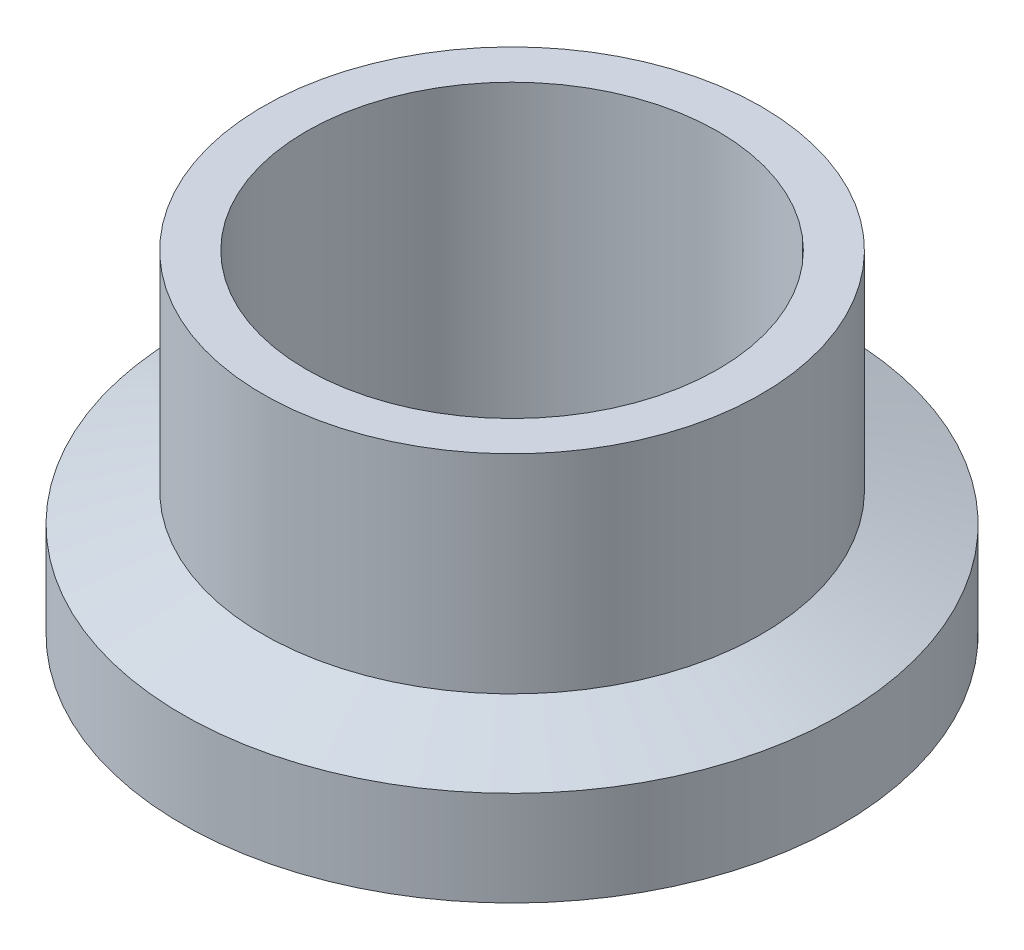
from build123d import *


with BuildPart() as part:
    # Sketch1 → Revolve1 (revolve)
    with BuildSketch(Plane.XY, mode=Mode.PRIVATE) as revolve1_sk:
        with BuildLine():
            Line((-7.874, 0.889), (-7.874, 12.7))
            Line((-7.874, 12.7), (-9.525, 12.7))
            Line((-9.525, 12.7), (-9.525, 4.750826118))
            Line((-9.525, 4.750826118), (-12.5984, 3.6322))
            Line((-12.5984, 3.6322), (-12.5984, 0))
            Line((-12.5984, 0), (-10.922, 0))
            Line((-10.922, 0), (-10.922, 1.3208))
            ThreePointArc((-10.922, 1.3208), (-10.433686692, 2.040621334), (-9.584339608, 1.852998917))
            Line((-9.584339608, 1.852998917), (-8.60238726, 0.889))
            Line((-8.60238726, 0.889), (-7.874, 0.889))
        make_face()
    revolve(revolve1_sk.sketch.rotate(Axis((0, 0, 0), (0, 1, 0)), 270), axis=Axis((0, 0, 0), (0, 1, 0)))


solid = part.part
